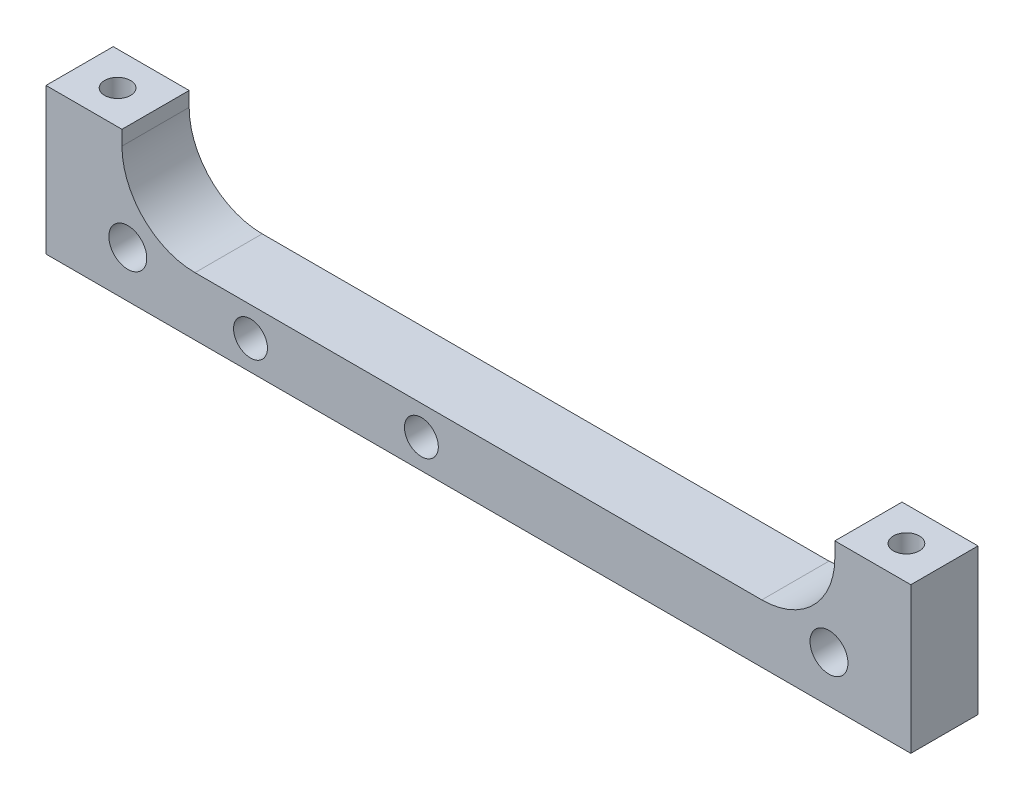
from build123d import *

# Parameters (mm, degrees)
SKETCH1_W                   = 75.184
SKETCH1_H                   = 12.7
EXTRUDE1_DEPTH              = 5.842
SKETCH2_W                   = 61.976
SKETCH2_H                   = 7.62
CUT_EXTRUDE1_DEPTH          = 77.472562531
FILLET1_R                   = 6.35
F_4_40_TAPPED_HOLE3_D       = 2.2606
F_4_40_TAPPED_HOLE3_DEPTH   = 8.509
F_4_40_TAPPED_HOLE3_TIP     = 0.679152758
F_32_0_116_DIAMETER_HOLE2_D = 2.9464
M4X0_7_TAPPED_HOLE1_D       = 3.3


with BuildPart() as part:
    # Sketch1 → Extrude1 (new body)
    with BuildSketch(Plane.XY):
        with Locations((37.592, -6.35)):
            Rectangle(SKETCH1_W, SKETCH1_H)
    extrude(amount=EXTRUDE1_DEPTH)

    # Sketch2 → Cut-Extrude1 (cut, through all)
    with BuildSketch(Plane.XY.offset(5.842)):
        with Locations((37.592, -3.81)):
            Rectangle(SKETCH2_W, SKETCH2_H)
    extrude(amount=-CUT_EXTRUDE1_DEPTH, mode=Mode.SUBTRACT)

    # Fillet1
    fillet1_edges = [part.edges().sort_by_distance(p)[0] for p in [
        (6.604, -7.62, 2.921),
        (68.58, -7.62, 2.921),
    ]]
    fillet(fillet1_edges, radius=FILLET1_R)

    # 4-40 Tapped Hole3
    with Locations(Plane(origin=(0, 0, 0), x_dir=(-1, 0, 0), z_dir=(0, 1, 0))):
        with Locations((-3.302, 2.921), (-71.882, 2.921)):
            Hole(F_4_40_TAPPED_HOLE3_D / 2, depth=F_4_40_TAPPED_HOLE3_DEPTH)
            with Locations((0, 0, -(F_4_40_TAPPED_HOLE3_DEPTH + F_4_40_TAPPED_HOLE3_TIP / 2))):  # 118° drill point
                Cone(0, F_4_40_TAPPED_HOLE3_D / 2, F_4_40_TAPPED_HOLE3_TIP, mode=Mode.SUBTRACT)

    # 32 _0.116_ Diameter Hole2 (through all)
    with Locations(Plane(origin=(0, 0, 0), x_dir=(-1, 0, 0), z_dir=(0, 0, -1))):
        with Locations((-32.6334374, -10.16), (-17.78, -10.16)):
            Hole(F_32_0_116_DIAMETER_HOLE2_D / 2)

    # M4x0.7 Tapped Hole1 (through all)
    with Locations(Plane(origin=(0, 0, 0), x_dir=(-1, 0, 0), z_dir=(0, 0, -1))):
        with Locations((-68.072, -8.643945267), (-7.112, -8.643945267)):
            Hole(M4X0_7_TAPPED_HOLE1_D / 2)


solid = part.part
